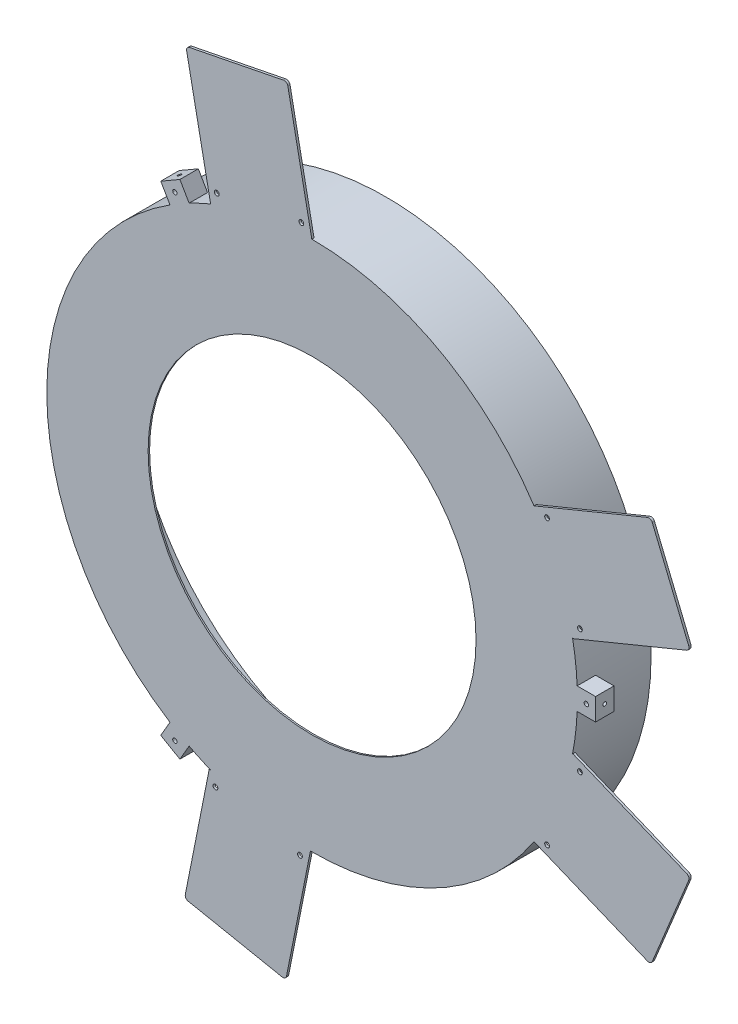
from build123d import *

# Parameters (mm, degrees)
ESQUISSE1_R             = 360
EXTRUSION1_DEPTH        = 100
ESQUISSE2_R             = 3.25
EXTRUSION6_DEPTH        = 3
CONG_1_R                = 5
ESQUISSE5_R             = 350.526132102
ENL_V_MAT_EXTRU_1_DEPTH = 98
ESQUISSE6_R             = 222.5
ENL_V_MAT_EXTRU_2_DEPTH = 98
ESQUISSE7_W             = 25
ESQUISSE7_H             = 30
ESQUISSE7_R             = 3
EXTRUSION7_DEPTH        = 25
ESQUISSE10_R            = 2.5
ENL_V_MAT_EXTRU_3_DEPTH = 5
ESQUISSE11_R            = 2.5
ENL_V_MAT_EXTRU_4_DEPTH = 5
ESQUISSE12_R            = 2.5
ENL_V_MAT_EXTRU_5_DEPTH = 5


with BuildPart() as part:
    # Esquisse1 → Extrusion1 (new body)
    with BuildSketch(Plane.XY):
        Circle(ESQUISSE1_R)
    extrude(amount=EXTRUSION1_DEPTH)

    # Esquisse2 → Extrusion6 (add)
    # profile 1 of 4: a face of its own
    with BuildSketch(Plane.XY.offset(100)):
        Polygon((-137.680834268, 332.631910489), (-0.36739602, 359.926969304), (-33.868226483, 528.60880317), (-171.186270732, 501.33693628), align=None)
        with Locations((-129.323123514, 349.584747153)):
            Circle(ESQUISSE2_R, mode=Mode.SUBTRACT)
        with Locations((-14.564472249, 372.37623591)):
            Circle(ESQUISSE2_R, mode=Mode.SUBTRACT)
    # profile 2 of 4: a face of its own
    with BuildSketch(Plane.XY.offset(100)):
        Polygon((459.739876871, 262.597564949), (300.701832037, 197.153899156), (353.955580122, 67.677882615), (513.015204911, 133.130428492), align=None)
        with Locations((318.927918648, 192.218289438)):
            Circle(ESQUISSE2_R, mode=Mode.SUBTRACT)
        with Locations((363.450871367, 84.020753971)):
            Circle(ESQUISSE2_R, mode=Mode.SUBTRACT)
    # profile 3 of 4: a face of its own
    with BuildSketch(Plane.XY.offset(100)):
        Polygon((353.955580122, -67.677882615), (300.701832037, -197.153899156), (459.739876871, -262.597564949), (513.015204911, -133.130428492), align=None)
        with Locations((318.927918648, -192.218289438)):
            Circle(ESQUISSE2_R, mode=Mode.SUBTRACT)
        with Locations((363.450871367, -84.020753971)):
            Circle(ESQUISSE2_R, mode=Mode.SUBTRACT)
    # profile 4 of 4: a face of its own
    with BuildSketch(Plane.XY.offset(100)):
        Polygon((-173.011117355, -500.974515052), (-35.693073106, -528.246381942), (-2.192182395, -359.564244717), (-139.505680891, -332.269489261), align=None)
        with Locations((-131.147970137, -349.222325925)):
            Circle(ESQUISSE2_R, mode=Mode.SUBTRACT)
        with Locations((-16.389318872, -372.013814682)):
            Circle(ESQUISSE2_R, mode=Mode.SUBTRACT)
    extrude(amount=-EXTRUSION6_DEPTH)

    # Cong_1
    cong_1_edges = [part.edges().sort_by_distance(p)[0] for p in [
        (459.739876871, 262.597564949, 98.5),
        (513.015204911, 133.130428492, 98.5),
        (513.015204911, -133.130428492, 98.5),
        (459.739876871, -262.597564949, 98.5),
        (-35.693073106, -528.246381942, 98.5),
        (-173.011117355, -500.974515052, 98.5),
        (-33.868226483, 528.60880317, 98.5),
        (-171.186270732, 501.33693628, 98.5),
    ]]
    fillet(cong_1_edges, radius=CONG_1_R)

    # Esquisse5 → Enl_v. mat.-Extru.1 (cut)
    with BuildSketch(Plane(origin=(0, 0, 0), x_dir=(-1, 0, 0), z_dir=(0, 0, -1))):
        Circle(ESQUISSE5_R)
    extrude(amount=-ENL_V_MAT_EXTRU_1_DEPTH, mode=Mode.SUBTRACT)

    # Esquisse6 → Enl_v. mat.-Extru.2 (cut)
    with BuildSketch(Plane.XY.offset(100)):
        Circle(ESQUISSE6_R)
    extrude(amount=-ENL_V_MAT_EXTRU_2_DEPTH, mode=Mode.SUBTRACT)

    # Esquisse7 → Extrusion7 (add)
    # profile 1 of 3: a face of its own
    with BuildSketch(Plane.XY.offset(100)):
        with Locations((372.187364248, 0)):
            Rectangle(ESQUISSE7_W, ESQUISSE7_H)
        with Locations((372.187364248, 0)):
            Circle(ESQUISSE7_R, mode=Mode.SUBTRACT)
    # profile 2 of 3: a face of its own
    with BuildSketch(Plane.XY.offset(100)):
        Polygon((-192.834063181, 303.998394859), (-205.334063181, 325.649029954), (-179.353301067, 340.649029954), (-166.853301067, 318.998394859), align=None)
        with Locations(Location((-186.093682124, 322.323712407, 0), (0, 0, 180))):
            Circle(ESQUISSE7_R, mode=Mode.SUBTRACT)
    # profile 3 of 3: a face of its own
    with BuildSketch(Plane.XY.offset(100)):
        Polygon((-166.853301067, -318.998394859), (-179.353301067, -340.649029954), (-205.334063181, -325.649029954), (-192.834063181, -303.998394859), align=None)
        with Locations(Location((-186.093682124, -322.323712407, 0), (0, 0, 180))):
            Circle(ESQUISSE7_R, mode=Mode.SUBTRACT)
    extrude(amount=-EXTRUSION7_DEPTH)

    # Esquisse10 → Enl_v. mat.-Extru.3 (cut)
    with BuildSketch(Plane(origin=(384.687364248, 0, 0), x_dir=(0, 0, -1), z_dir=(1, 0, 0))):
        with Locations(Location((-87.5, 0, 0), (0, 0, 90))):
            Circle(ESQUISSE10_R)
    extrude(amount=-ENL_V_MAT_EXTRU_3_DEPTH, mode=Mode.SUBTRACT)

    # Esquisse11 → Enl_v. mat.-Extru.4 (cut)
    with BuildSketch(Plane(origin=(-192.343682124, 333.149029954, 0), x_dir=(0.8660254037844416, 0.499999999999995, 0), z_dir=(-0.499999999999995, 0.8660254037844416, 0))):
        with Locations(Location((0, -87.5, 0), (0, 0, 180))):
            Circle(ESQUISSE11_R)
    extrude(amount=-ENL_V_MAT_EXTRU_4_DEPTH, mode=Mode.SUBTRACT)

    # Esquisse12 → Enl_v. mat.-Extru.5 (cut)
    with BuildSketch(Plane(origin=(-192.343682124, -333.149029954, 0), x_dir=(0.8660254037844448, -0.49999999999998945, 0), z_dir=(-0.4999999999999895, -0.8660254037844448, 0))):
        with Locations((0, 87.5)):
            Circle(ESQUISSE12_R)
    extrude(amount=-ENL_V_MAT_EXTRU_5_DEPTH, mode=Mode.SUBTRACT)


solid = part.part
